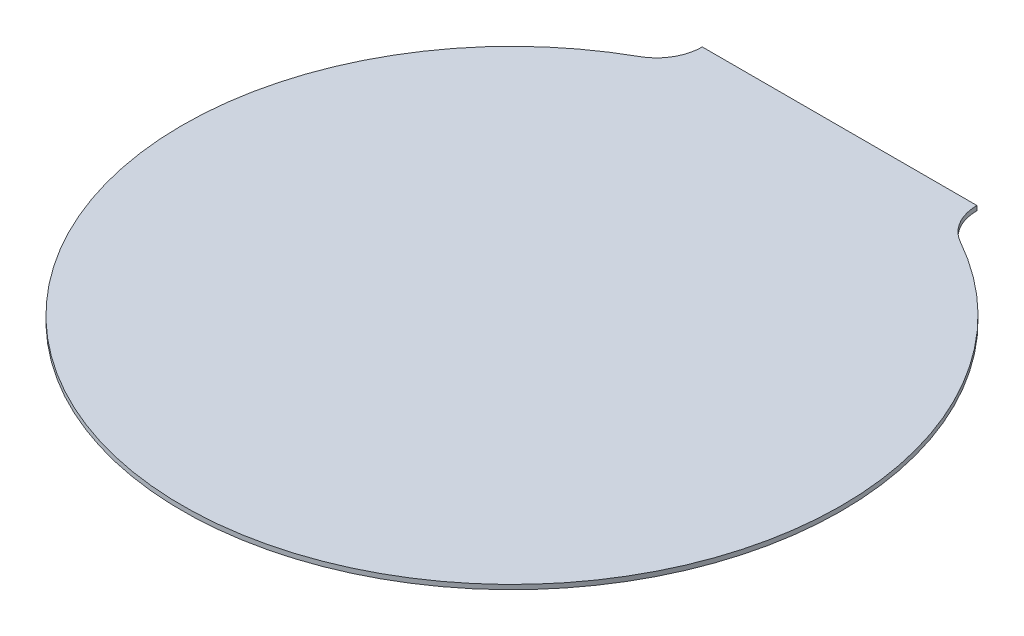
ISO-10303-21;
HEADER;
FILE_DESCRIPTION(('STEP AP214'),'2;1');
FILE_NAME('part.step','',(''),(''),'','','');
FILE_SCHEMA(('AUTOMOTIVE_DESIGN { 1 0 10303 214 1 1 1 1 }'));
ENDSEC;
DATA;
#1=APPLICATION_CONTEXT('core data for automotive mechanical design processes');
#2=APPLICATION_PROTOCOL_DEFINITION('international standard','automotive_design',2000,#1);
#3=PRODUCT_CONTEXT('',#1,'mechanical');
#4=PRODUCT('Part','Part','',(#3));
#5=PRODUCT_RELATED_PRODUCT_CATEGORY('part','',(#4));
#6=PRODUCT_DEFINITION_FORMATION('','',#4);
#7=PRODUCT_DEFINITION_CONTEXT('part definition',#1,'design');
#8=PRODUCT_DEFINITION('design','',#6,#7);
#9=PRODUCT_DEFINITION_SHAPE('','',#8);
#10=(LENGTH_UNIT() NAMED_UNIT(*) SI_UNIT(.MILLI.,.METRE.));
#11=(NAMED_UNIT(*) PLANE_ANGLE_UNIT() SI_UNIT($,.RADIAN.));
#12=(NAMED_UNIT(*) SI_UNIT($,.STERADIAN.) SOLID_ANGLE_UNIT());
#13=UNCERTAINTY_MEASURE_WITH_UNIT(LENGTH_MEASURE(1.E-05),#10,'distance_accuracy_value','');
#14=(GEOMETRIC_REPRESENTATION_CONTEXT(3) GLOBAL_UNCERTAINTY_ASSIGNED_CONTEXT((#13)) GLOBAL_UNIT_ASSIGNED_CONTEXT((#10,
#11,#12)) REPRESENTATION_CONTEXT('',''));
#15=CARTESIAN_POINT('',(0.,0.,0.));
#16=DIRECTION('',(0.,0.,1.));
#17=DIRECTION('',(1.,0.,0.));
#18=AXIS2_PLACEMENT_3D('',#15,#16,#17);
#19=CARTESIAN_POINT('',(-5.07969240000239,0.127,-9.09110120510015));
#20=DIRECTION('',(0.,-1.,0.));
#21=DIRECTION('',(0.,0.,-1.));
#22=AXIS2_PLACEMENT_3D('',#19,#20,#21);
#23=CYLINDRICAL_SURFACE('',#22,1.27000000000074);
#24=CARTESIAN_POINT('',(-5.07969240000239,0.,-9.09110120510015));
#25=DIRECTION('',(0.,-1.,0.));
#26=DIRECTION('',(0.,0.,1.));
#27=AXIS2_PLACEMENT_3D('',#24,#25,#26);
#28=CIRCLE('',#27,1.27000000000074);
#29=CARTESIAN_POINT('',(-3.80969240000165,0.,-9.09110120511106));
#30=VERTEX_POINT('',#29);
#31=CARTESIAN_POINT('',(-4.46021771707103,0.,-7.98243032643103));
#32=VERTEX_POINT('',#31);
#33=EDGE_CURVE('E93',#30,#32,#28,.T.);
#34=ORIENTED_EDGE('',*,*,#33,.T.);
#35=DIRECTION('',(0.,-1.,0.));
#36=VECTOR('',#35,1.);
#37=CARTESIAN_POINT('',(-4.46021771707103,0.127,-7.98243032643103));
#38=LINE('',#37,#36);
#39=CARTESIAN_POINT('',(-4.46021771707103,0.127,-7.98243032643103));
#40=VERTEX_POINT('',#39);
#41=EDGE_CURVE('E11',#40,#32,#38,.T.);
#42=ORIENTED_EDGE('',*,*,#41,.F.);
#43=CARTESIAN_POINT('',(-5.07969240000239,0.127,-9.09110120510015));
#44=DIRECTION('',(0.,-1.,0.));
#45=DIRECTION('',(0.,0.,1.));
#46=AXIS2_PLACEMENT_3D('',#43,#44,#45);
#47=CIRCLE('',#46,1.27000000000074);
#48=CARTESIAN_POINT('',(-3.80969240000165,0.127,-9.09110120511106));
#49=VERTEX_POINT('',#48);
#50=EDGE_CURVE('E81',#49,#40,#47,.T.);
#51=ORIENTED_EDGE('',*,*,#50,.F.);
#52=DIRECTION('',(0.,-1.,0.));
#53=VECTOR('',#52,1.);
#54=CARTESIAN_POINT('',(-3.80969240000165,0.127,-9.09110120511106));
#55=LINE('',#54,#53);
#56=EDGE_CURVE('E89',#49,#30,#55,.T.);
#57=ORIENTED_EDGE('',*,*,#56,.T.);
#58=EDGE_LOOP('',(#34,#42,#51,#57));
#59=FACE_BOUND('',#58,.T.);
#60=ADVANCED_FACE('F30',(#59),#23,.F.);
#61=CARTESIAN_POINT('',(0.,0.127,0.));
#62=DIRECTION('',(0.,-1.,0.));
#63=DIRECTION('',(0.,0.,-1.));
#64=AXIS2_PLACEMENT_3D('',#61,#62,#63);
#65=CYLINDRICAL_SURFACE('',#64,9.14400000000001);
#66=CARTESIAN_POINT('',(0.,0.,0.));
#67=DIRECTION('',(0.,1.,0.));
#68=DIRECTION('',(0.,0.,1.));
#69=AXIS2_PLACEMENT_3D('',#66,#67,#68);
#70=CIRCLE('',#69,9.14400000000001);
#71=CARTESIAN_POINT('',(4.4602177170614,0.,-7.98243032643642));
#72=VERTEX_POINT('',#71);
#73=EDGE_CURVE('E85',#32,#72,#70,.T.);
#74=ORIENTED_EDGE('',*,*,#73,.T.);
#75=DIRECTION('',(0.,-1.,0.));
#76=VECTOR('',#75,1.);
#77=CARTESIAN_POINT('',(4.4602177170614,0.127,-7.98243032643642));
#78=LINE('',#77,#76);
#79=CARTESIAN_POINT('',(4.4602177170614,0.127,-7.98243032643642));
#80=VERTEX_POINT('',#79);
#81=EDGE_CURVE('E38',#80,#72,#78,.T.);
#82=ORIENTED_EDGE('',*,*,#81,.F.);
#83=CARTESIAN_POINT('',(0.,0.127,0.));
#84=DIRECTION('',(0.,1.,0.));
#85=DIRECTION('',(0.,0.,1.));
#86=AXIS2_PLACEMENT_3D('',#83,#84,#85);
#87=CIRCLE('',#86,9.14400000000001);
#88=EDGE_CURVE('E76',#40,#80,#87,.T.);
#89=ORIENTED_EDGE('',*,*,#88,.F.);
#90=ORIENTED_EDGE('',*,*,#41,.T.);
#91=EDGE_LOOP('',(#74,#82,#89,#90));
#92=FACE_BOUND('',#91,.T.);
#93=ADVANCED_FACE('F84',(#92),#65,.T.);
#94=CARTESIAN_POINT('',(5.07969239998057,0.127,-9.09110120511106));
#95=DIRECTION('',(0.,-1.,0.));
#96=DIRECTION('',(0.,0.,-1.));
#97=AXIS2_PLACEMENT_3D('',#94,#95,#96);
#98=CYLINDRICAL_SURFACE('',#97,1.26999999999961);
#99=CARTESIAN_POINT('',(5.07969239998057,0.,-9.09110120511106));
#100=DIRECTION('',(0.,-1.,0.));
#101=DIRECTION('',(0.,0.,1.));
#102=AXIS2_PLACEMENT_3D('',#99,#100,#101);
#103=CIRCLE('',#102,1.26999999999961);
#104=CARTESIAN_POINT('',(3.80969239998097,0.,-9.09110120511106));
#105=VERTEX_POINT('',#104);
#106=EDGE_CURVE('E63',#72,#105,#103,.T.);
#107=ORIENTED_EDGE('',*,*,#106,.T.);
#108=DIRECTION('',(0.,-1.,0.));
#109=VECTOR('',#108,1.);
#110=CARTESIAN_POINT('',(3.80969239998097,0.127,-9.09110120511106));
#111=LINE('',#110,#109);
#112=CARTESIAN_POINT('',(3.80969239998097,0.127,-9.09110120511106));
#113=VERTEX_POINT('',#112);
#114=EDGE_CURVE('E86',#113,#105,#111,.T.);
#115=ORIENTED_EDGE('',*,*,#114,.F.);
#116=CARTESIAN_POINT('',(5.07969239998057,0.127,-9.09110120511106));
#117=DIRECTION('',(0.,-1.,0.));
#118=DIRECTION('',(0.,0.,1.));
#119=AXIS2_PLACEMENT_3D('',#116,#117,#118);
#120=CIRCLE('',#119,1.26999999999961);
#121=EDGE_CURVE('E79',#80,#113,#120,.T.);
#122=ORIENTED_EDGE('',*,*,#121,.F.);
#123=ORIENTED_EDGE('',*,*,#81,.T.);
#124=EDGE_LOOP('',(#107,#115,#122,#123));
#125=FACE_BOUND('',#124,.T.);
#126=ADVANCED_FACE('F87',(#125),#98,.F.);
#127=CARTESIAN_POINT('',(3.80969239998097,0.127,-9.09110120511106));
#128=DIRECTION('',(0.,0.,1.));
#129=DIRECTION('',(1.,0.,0.));
#130=AXIS2_PLACEMENT_3D('',#127,#128,#129);
#131=PLANE('',#130);
#132=DIRECTION('',(-1.,0.,0.));
#133=VECTOR('',#132,1.);
#134=CARTESIAN_POINT('',(3.80969239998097,0.,-9.09110120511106));
#135=LINE('',#134,#133);
#136=EDGE_CURVE('E69',#105,#30,#135,.T.);
#137=ORIENTED_EDGE('',*,*,#136,.T.);
#138=ORIENTED_EDGE('',*,*,#56,.F.);
#139=DIRECTION('',(-1.,0.,0.));
#140=VECTOR('',#139,1.);
#141=CARTESIAN_POINT('',(3.80969239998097,0.127,-9.09110120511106));
#142=LINE('',#141,#140);
#143=EDGE_CURVE('E46',#113,#49,#142,.T.);
#144=ORIENTED_EDGE('',*,*,#143,.F.);
#145=ORIENTED_EDGE('',*,*,#114,.T.);
#146=EDGE_LOOP('',(#137,#138,#144,#145));
#147=FACE_BOUND('',#146,.T.);
#148=ADVANCED_FACE('F100',(#147),#131,.F.);
#149=CARTESIAN_POINT('',(-5.07969240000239,0.127,-9.09110120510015));
#150=DIRECTION('',(0.,1.,0.));
#151=DIRECTION('',(0.,0.,1.));
#152=AXIS2_PLACEMENT_3D('',#149,#150,#151);
#153=PLANE('',#152);
#154=ORIENTED_EDGE('',*,*,#50,.T.);
#155=ORIENTED_EDGE('',*,*,#88,.T.);
#156=ORIENTED_EDGE('',*,*,#121,.T.);
#157=ORIENTED_EDGE('',*,*,#143,.T.);
#158=EDGE_LOOP('',(#154,#155,#156,#157));
#159=FACE_BOUND('',#158,.T.);
#160=ADVANCED_FACE('F77',(#159),#153,.T.);
#161=CARTESIAN_POINT('',(-5.07969240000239,0.,-9.09110120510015));
#162=DIRECTION('',(0.,1.,0.));
#163=DIRECTION('',(0.,0.,1.));
#164=AXIS2_PLACEMENT_3D('',#161,#162,#163);
#165=PLANE('',#164);
#166=ORIENTED_EDGE('',*,*,#33,.F.);
#167=ORIENTED_EDGE('',*,*,#136,.F.);
#168=ORIENTED_EDGE('',*,*,#106,.F.);
#169=ORIENTED_EDGE('',*,*,#73,.F.);
#170=EDGE_LOOP('',(#166,#167,#168,#169));
#171=FACE_BOUND('',#170,.T.);
#172=ADVANCED_FACE('F103',(#171),#165,.F.);
#173=CLOSED_SHELL('',(#60,#93,#126,#148,#160,#172));
#174=MANIFOLD_SOLID_BREP('B2',#173);
#175=ADVANCED_BREP_SHAPE_REPRESENTATION('',(#18,#174),#14);
#176=SHAPE_DEFINITION_REPRESENTATION(#9,#175);
ENDSEC;
END-ISO-10303-21;
